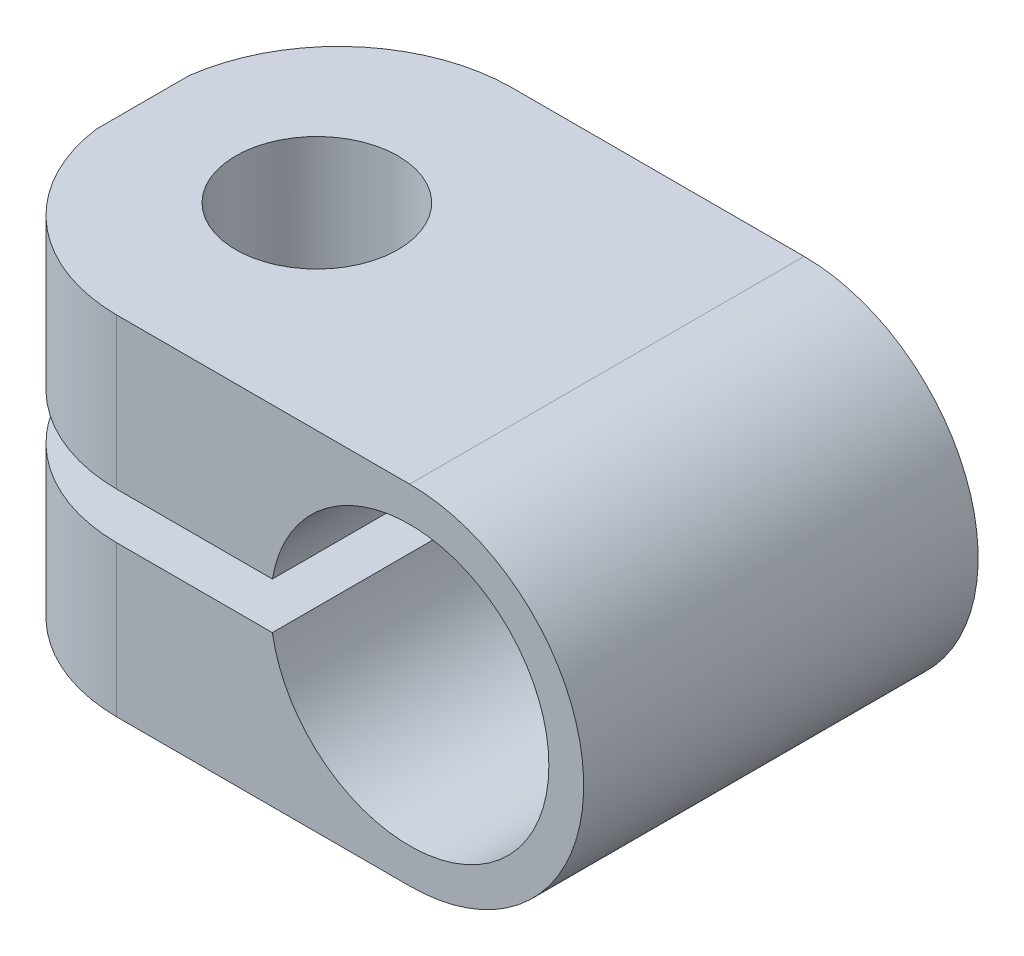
ISO-10303-21;
HEADER;
FILE_DESCRIPTION(('STEP AP214'),'2;1');
FILE_NAME('part.step','',(''),(''),'','','');
FILE_SCHEMA(('AUTOMOTIVE_DESIGN { 1 0 10303 214 1 1 1 1 }'));
ENDSEC;
DATA;
#1=APPLICATION_CONTEXT('core data for automotive mechanical design processes');
#2=APPLICATION_PROTOCOL_DEFINITION('international standard','automotive_design',2000,#1);
#3=PRODUCT_CONTEXT('',#1,'mechanical');
#4=PRODUCT('Part','Part','',(#3));
#5=PRODUCT_RELATED_PRODUCT_CATEGORY('part','',(#4));
#6=PRODUCT_DEFINITION_FORMATION('','',#4);
#7=PRODUCT_DEFINITION_CONTEXT('part definition',#1,'design');
#8=PRODUCT_DEFINITION('design','',#6,#7);
#9=PRODUCT_DEFINITION_SHAPE('','',#8);
#10=(LENGTH_UNIT() NAMED_UNIT(*) SI_UNIT(.MILLI.,.METRE.));
#11=(NAMED_UNIT(*) PLANE_ANGLE_UNIT() SI_UNIT($,.RADIAN.));
#12=(NAMED_UNIT(*) SI_UNIT($,.STERADIAN.) SOLID_ANGLE_UNIT());
#13=UNCERTAINTY_MEASURE_WITH_UNIT(LENGTH_MEASURE(1.E-05),#10,'distance_accuracy_value','');
#14=(GEOMETRIC_REPRESENTATION_CONTEXT(3) GLOBAL_UNCERTAINTY_ASSIGNED_CONTEXT((#13)) GLOBAL_UNIT_ASSIGNED_CONTEXT((#10,
#11,#12)) REPRESENTATION_CONTEXT('',''));
#15=CARTESIAN_POINT('',(0.,0.,0.));
#16=DIRECTION('',(0.,0.,1.));
#17=DIRECTION('',(1.,0.,0.));
#18=AXIS2_PLACEMENT_3D('',#15,#16,#17);
#19=CARTESIAN_POINT('',(0.,0.,17.));
#20=DIRECTION('',(1.,0.,0.));
#21=DIRECTION('',(0.,0.,-1.));
#22=AXIS2_PLACEMENT_3D('',#19,#20,#21);
#23=PLANE('',#22);
#24=DIRECTION('',(0.,0.,1.));
#25=VECTOR('',#24,1.);
#26=CARTESIAN_POINT('',(0.,8.5,0.));
#27=LINE('',#26,#25);
#28=CARTESIAN_POINT('',(0.,8.5,6.49940134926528));
#29=VERTEX_POINT('',#28);
#30=CARTESIAN_POINT('',(0.,8.5,10.5005986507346));
#31=VERTEX_POINT('',#30);
#32=EDGE_CURVE('E178',#29,#31,#27,.T.);
#33=ORIENTED_EDGE('',*,*,#32,.T.);
#34=DIRECTION('',(0.,-1.,0.));
#35=VECTOR('',#34,1.);
#36=CARTESIAN_POINT('',(0.,15.,10.5005986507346));
#37=LINE('',#36,#35);
#38=CARTESIAN_POINT('',(0.,15.,10.5005986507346));
#39=VERTEX_POINT('',#38);
#40=EDGE_CURVE('E201',#31,#39,#37,.F.);
#41=ORIENTED_EDGE('',*,*,#40,.T.);
#42=DIRECTION('',(0.,0.,-1.));
#43=VECTOR('',#42,1.);
#44=CARTESIAN_POINT('',(0.,15.,17.));
#45=LINE('',#44,#43);
#46=CARTESIAN_POINT('',(0.,15.,6.49940134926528));
#47=VERTEX_POINT('',#46);
#48=EDGE_CURVE('E160',#39,#47,#45,.T.);
#49=ORIENTED_EDGE('',*,*,#48,.T.);
#50=DIRECTION('',(0.,-1.,0.));
#51=VECTOR('',#50,1.);
#52=CARTESIAN_POINT('',(0.,15.,6.49940134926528));
#53=LINE('',#52,#51);
#54=EDGE_CURVE('E185',#47,#29,#53,.T.);
#55=ORIENTED_EDGE('',*,*,#54,.T.);
#56=EDGE_LOOP('',(#33,#41,#49,#55));
#57=FACE_BOUND('',#56,.T.);
#58=ADVANCED_FACE('F28',(#57),#23,.F.);
#59=CARTESIAN_POINT('',(0.,0.,17.));
#60=DIRECTION('',(0.,1.,0.));
#61=DIRECTION('',(0.,0.,1.));
#62=AXIS2_PLACEMENT_3D('',#59,#60,#61);
#63=PLANE('',#62);
#64=CARTESIAN_POINT('',(7.5,0.,8.5));
#65=DIRECTION('',(0.,-1.,0.));
#66=DIRECTION('',(0.,0.,-1.));
#67=AXIS2_PLACEMENT_3D('',#64,#65,#66);
#68=CIRCLE('',#67,3.5);
#69=CARTESIAN_POINT('',(7.5,0.,5.));
#70=VERTEX_POINT('',#69);
#71=EDGE_CURVE('E244',#70,#70,#68,.T.);
#72=ORIENTED_EDGE('',*,*,#71,.F.);
#73=EDGE_LOOP('',(#72));
#74=FACE_BOUND('',#73,.T.);
#75=DIRECTION('',(1.,0.,0.));
#76=VECTOR('',#75,1.);
#77=CARTESIAN_POINT('',(0.,0.,17.));
#78=LINE('',#77,#76);
#79=CARTESIAN_POINT('',(7.36598819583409,0.,17.));
#80=VERTEX_POINT('',#79);
#81=CARTESIAN_POINT('',(20.,0.,17.));
#82=VERTEX_POINT('',#81);
#83=EDGE_CURVE('E153',#80,#82,#78,.T.);
#84=ORIENTED_EDGE('',*,*,#83,.F.);
#85=CARTESIAN_POINT('',(7.43299409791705,0.,9.50029932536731));
#86=DIRECTION('',(0.,1.,0.));
#87=DIRECTION('',(0.,0.,-1.));
#88=AXIS2_PLACEMENT_3D('',#85,#86,#87);
#89=CIRCLE('',#88,7.5);
#90=CARTESIAN_POINT('',(0.,0.,10.5005986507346));
#91=VERTEX_POINT('',#90);
#92=EDGE_CURVE('E137',#91,#80,#89,.T.);
#93=ORIENTED_EDGE('',*,*,#92,.F.);
#94=DIRECTION('',(0.,0.,-1.));
#95=VECTOR('',#94,1.);
#96=CARTESIAN_POINT('',(0.,0.,17.));
#97=LINE('',#96,#95);
#98=CARTESIAN_POINT('',(0.,0.,6.49940134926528));
#99=VERTEX_POINT('',#98);
#100=EDGE_CURVE('E135',#91,#99,#97,.T.);
#101=ORIENTED_EDGE('',*,*,#100,.T.);
#102=CARTESIAN_POINT('',(7.43299409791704,0.,7.49970067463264));
#103=DIRECTION('',(0.,1.,0.));
#104=DIRECTION('',(0.,0.,1.));
#105=AXIS2_PLACEMENT_3D('',#102,#103,#104);
#106=CIRCLE('',#105,7.5);
#107=CARTESIAN_POINT('',(7.36598819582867,0.,0.));
#108=VERTEX_POINT('',#107);
#109=EDGE_CURVE('E121',#108,#99,#106,.T.);
#110=ORIENTED_EDGE('',*,*,#109,.F.);
#111=DIRECTION('',(1.,0.,0.));
#112=VECTOR('',#111,1.);
#113=CARTESIAN_POINT('',(0.,0.,0.));
#114=LINE('',#113,#112);
#115=CARTESIAN_POINT('',(20.,0.,0.));
#116=VERTEX_POINT('',#115);
#117=EDGE_CURVE('E131',#108,#116,#114,.T.);
#118=ORIENTED_EDGE('',*,*,#117,.T.);
#119=DIRECTION('',(0.,0.,-1.));
#120=VECTOR('',#119,1.);
#121=CARTESIAN_POINT('',(20.,0.,17.));
#122=LINE('',#121,#120);
#123=EDGE_CURVE('E165',#82,#116,#122,.T.);
#124=ORIENTED_EDGE('',*,*,#123,.F.);
#125=EDGE_LOOP('',(#84,#93,#101,#110,#118,#124));
#126=FACE_BOUND('',#125,.T.);
#127=ADVANCED_FACE('F30',(#74,#126),#63,.F.);
#128=CARTESIAN_POINT('',(20.,7.5,17.));
#129=DIRECTION('',(0.,0.,-1.));
#130=DIRECTION('',(-1.,0.,0.));
#131=AXIS2_PLACEMENT_3D('',#128,#129,#130);
#132=CYLINDRICAL_SURFACE('',#131,7.5);
#133=CARTESIAN_POINT('',(20.,7.5,0.));
#134=DIRECTION('',(0.,0.,1.));
#135=DIRECTION('',(-1.,0.,0.));
#136=AXIS2_PLACEMENT_3D('',#133,#134,#135);
#137=CIRCLE('',#136,7.5);
#138=CARTESIAN_POINT('',(20.,15.,0.));
#139=VERTEX_POINT('',#138);
#140=EDGE_CURVE('E141',#116,#139,#137,.T.);
#141=ORIENTED_EDGE('',*,*,#140,.T.);
#142=DIRECTION('',(0.,0.,-1.));
#143=VECTOR('',#142,1.);
#144=CARTESIAN_POINT('',(20.,15.,17.));
#145=LINE('',#144,#143);
#146=CARTESIAN_POINT('',(20.,15.,17.));
#147=VERTEX_POINT('',#146);
#148=EDGE_CURVE('E162',#147,#139,#145,.T.);
#149=ORIENTED_EDGE('',*,*,#148,.F.);
#150=CARTESIAN_POINT('',(20.,7.5,17.));
#151=DIRECTION('',(0.,0.,1.));
#152=DIRECTION('',(-1.,0.,0.));
#153=AXIS2_PLACEMENT_3D('',#150,#151,#152);
#154=CIRCLE('',#153,7.5);
#155=EDGE_CURVE('E155',#82,#147,#154,.T.);
#156=ORIENTED_EDGE('',*,*,#155,.F.);
#157=ORIENTED_EDGE('',*,*,#123,.T.);
#158=EDGE_LOOP('',(#141,#149,#156,#157));
#159=FACE_BOUND('',#158,.T.);
#160=ADVANCED_FACE('F252',(#159),#132,.T.);
#161=CARTESIAN_POINT('',(0.,15.,17.));
#162=DIRECTION('',(0.,-1.,0.));
#163=DIRECTION('',(0.,0.,-1.));
#164=AXIS2_PLACEMENT_3D('',#161,#162,#163);
#165=PLANE('',#164);
#166=CARTESIAN_POINT('',(7.5,15.,8.5));
#167=DIRECTION('',(0.,-1.,0.));
#168=DIRECTION('',(0.,0.,-1.));
#169=AXIS2_PLACEMENT_3D('',#166,#167,#168);
#170=CIRCLE('',#169,3.5);
#171=CARTESIAN_POINT('',(7.5,15.,5.));
#172=VERTEX_POINT('',#171);
#173=EDGE_CURVE('E241',#172,#172,#170,.T.);
#174=ORIENTED_EDGE('',*,*,#173,.T.);
#175=EDGE_LOOP('',(#174));
#176=FACE_BOUND('',#175,.T.);
#177=ORIENTED_EDGE('',*,*,#48,.F.);
#178=CARTESIAN_POINT('',(7.43299409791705,15.,9.50029932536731));
#179=DIRECTION('',(0.,1.,0.));
#180=DIRECTION('',(0.,0.,-1.));
#181=AXIS2_PLACEMENT_3D('',#178,#179,#180);
#182=CIRCLE('',#181,7.5);
#183=CARTESIAN_POINT('',(7.36598819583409,15.,17.));
#184=VERTEX_POINT('',#183);
#185=EDGE_CURVE('E136',#39,#184,#182,.T.);
#186=ORIENTED_EDGE('',*,*,#185,.T.);
#187=DIRECTION('',(-1.,0.,0.));
#188=VECTOR('',#187,1.);
#189=CARTESIAN_POINT('',(0.,15.,17.));
#190=LINE('',#189,#188);
#191=EDGE_CURVE('E157',#147,#184,#190,.T.);
#192=ORIENTED_EDGE('',*,*,#191,.F.);
#193=ORIENTED_EDGE('',*,*,#148,.T.);
#194=DIRECTION('',(-1.,0.,0.));
#195=VECTOR('',#194,1.);
#196=CARTESIAN_POINT('',(0.,15.,0.));
#197=LINE('',#196,#195);
#198=CARTESIAN_POINT('',(7.36598819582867,15.,0.));
#199=VERTEX_POINT('',#198);
#200=EDGE_CURVE('E145',#139,#199,#197,.T.);
#201=ORIENTED_EDGE('',*,*,#200,.T.);
#202=CARTESIAN_POINT('',(7.43299409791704,15.,7.49970067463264));
#203=DIRECTION('',(0.,1.,0.));
#204=DIRECTION('',(0.,0.,1.));
#205=AXIS2_PLACEMENT_3D('',#202,#203,#204);
#206=CIRCLE('',#205,7.5);
#207=EDGE_CURVE('E194',#199,#47,#206,.T.);
#208=ORIENTED_EDGE('',*,*,#207,.T.);
#209=EDGE_LOOP('',(#177,#186,#192,#193,#201,#208));
#210=FACE_BOUND('',#209,.T.);
#211=ADVANCED_FACE('F233',(#176,#210),#165,.F.);
#212=DIRECTION('',(0.,-1.,0.));
#213=VECTOR('',#212,1.);
#214=CARTESIAN_POINT('',(0.,15.,6.49940134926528));
#215=LINE('',#214,#213);
#216=CARTESIAN_POINT('',(0.,6.5,6.49940134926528));
#217=VERTEX_POINT('',#216);
#218=EDGE_CURVE('E52',#217,#99,#215,.T.);
#219=ORIENTED_EDGE('',*,*,#218,.T.);
#220=ORIENTED_EDGE('',*,*,#100,.F.);
#221=DIRECTION('',(0.,-1.,0.));
#222=VECTOR('',#221,1.);
#223=CARTESIAN_POINT('',(0.,15.,10.5005986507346));
#224=LINE('',#223,#222);
#225=CARTESIAN_POINT('',(0.,6.5,10.5005986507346));
#226=VERTEX_POINT('',#225);
#227=EDGE_CURVE('E205',#91,#226,#224,.F.);
#228=ORIENTED_EDGE('',*,*,#227,.T.);
#229=DIRECTION('',(0.,0.,1.));
#230=VECTOR('',#229,1.);
#231=CARTESIAN_POINT('',(0.,6.5,0.));
#232=LINE('',#231,#230);
#233=EDGE_CURVE('E215',#217,#226,#232,.T.);
#234=ORIENTED_EDGE('',*,*,#233,.F.);
#235=EDGE_LOOP('',(#219,#220,#228,#234));
#236=FACE_BOUND('',#235,.T.);
#237=ADVANCED_FACE('F259',(#236),#23,.F.);
#238=CARTESIAN_POINT('',(20.,7.5,17.));
#239=DIRECTION('',(0.,0.,-1.));
#240=DIRECTION('',(-1.,0.,0.));
#241=AXIS2_PLACEMENT_3D('',#238,#239,#240);
#242=PLANE('',#241);
#243=ORIENTED_EDGE('',*,*,#191,.T.);
#244=DIRECTION('',(0.,-1.,0.));
#245=VECTOR('',#244,1.);
#246=CARTESIAN_POINT('',(7.36598819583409,15.,17.));
#247=LINE('',#246,#245);
#248=CARTESIAN_POINT('',(7.36598819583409,8.5,17.));
#249=VERTEX_POINT('',#248);
#250=EDGE_CURVE('E198',#184,#249,#247,.T.);
#251=ORIENTED_EDGE('',*,*,#250,.T.);
#252=DIRECTION('',(-1.,0.,0.));
#253=VECTOR('',#252,1.);
#254=CARTESIAN_POINT('',(0.,8.5,17.));
#255=LINE('',#254,#253);
#256=CARTESIAN_POINT('',(14.0839202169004,8.5,17.));
#257=VERTEX_POINT('',#256);
#258=EDGE_CURVE('E210',#257,#249,#255,.T.);
#259=ORIENTED_EDGE('',*,*,#258,.F.);
#260=CARTESIAN_POINT('',(20.,7.5,17.));
#261=DIRECTION('',(0.,0.,1.));
#262=DIRECTION('',(1.,0.,0.));
#263=AXIS2_PLACEMENT_3D('',#260,#261,#262);
#264=CIRCLE('',#263,6.);
#265=CARTESIAN_POINT('',(14.0839202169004,6.5,17.));
#266=VERTEX_POINT('',#265);
#267=EDGE_CURVE('E148',#266,#257,#264,.T.);
#268=ORIENTED_EDGE('',*,*,#267,.F.);
#269=DIRECTION('',(1.,0.,0.));
#270=VECTOR('',#269,1.);
#271=CARTESIAN_POINT('',(16.436428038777,6.5,17.));
#272=LINE('',#271,#270);
#273=CARTESIAN_POINT('',(7.36598819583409,6.5,17.));
#274=VERTEX_POINT('',#273);
#275=EDGE_CURVE('E208',#274,#266,#272,.T.);
#276=ORIENTED_EDGE('',*,*,#275,.F.);
#277=EDGE_CURVE('E44',#274,#80,#247,.T.);
#278=ORIENTED_EDGE('',*,*,#277,.T.);
#279=ORIENTED_EDGE('',*,*,#83,.T.);
#280=ORIENTED_EDGE('',*,*,#155,.T.);
#281=EDGE_LOOP('',(#243,#251,#259,#268,#276,#278,#279,#280));
#282=FACE_BOUND('',#281,.T.);
#283=ADVANCED_FACE('F226',(#282),#242,.F.);
#284=CARTESIAN_POINT('',(20.,7.5,0.));
#285=DIRECTION('',(0.,0.,-1.));
#286=DIRECTION('',(-1.,0.,0.));
#287=AXIS2_PLACEMENT_3D('',#284,#285,#286);
#288=PLANE('',#287);
#289=DIRECTION('',(-1.,0.,0.));
#290=VECTOR('',#289,1.);
#291=CARTESIAN_POINT('',(0.,8.5,0.));
#292=LINE('',#291,#290);
#293=CARTESIAN_POINT('',(14.0839202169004,8.5,0.));
#294=VERTEX_POINT('',#293);
#295=CARTESIAN_POINT('',(7.36598819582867,8.5,0.));
#296=VERTEX_POINT('',#295);
#297=EDGE_CURVE('E177',#294,#296,#292,.T.);
#298=ORIENTED_EDGE('',*,*,#297,.T.);
#299=DIRECTION('',(0.,-1.,0.));
#300=VECTOR('',#299,1.);
#301=CARTESIAN_POINT('',(7.36598819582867,15.,0.));
#302=LINE('',#301,#300);
#303=EDGE_CURVE('E127',#199,#296,#302,.T.);
#304=ORIENTED_EDGE('',*,*,#303,.F.);
#305=ORIENTED_EDGE('',*,*,#200,.F.);
#306=ORIENTED_EDGE('',*,*,#140,.F.);
#307=ORIENTED_EDGE('',*,*,#117,.F.);
#308=CARTESIAN_POINT('',(7.36598819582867,6.5,0.));
#309=VERTEX_POINT('',#308);
#310=EDGE_CURVE('E118',#309,#108,#302,.T.);
#311=ORIENTED_EDGE('',*,*,#310,.F.);
#312=DIRECTION('',(1.,0.,0.));
#313=VECTOR('',#312,1.);
#314=CARTESIAN_POINT('',(16.436428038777,6.5,0.));
#315=LINE('',#314,#313);
#316=CARTESIAN_POINT('',(14.0839202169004,6.5,0.));
#317=VERTEX_POINT('',#316);
#318=EDGE_CURVE('E212',#309,#317,#315,.T.);
#319=ORIENTED_EDGE('',*,*,#318,.T.);
#320=CARTESIAN_POINT('',(20.,7.5,0.));
#321=DIRECTION('',(0.,0.,1.));
#322=DIRECTION('',(1.,0.,0.));
#323=AXIS2_PLACEMENT_3D('',#320,#321,#322);
#324=CIRCLE('',#323,6.);
#325=EDGE_CURVE('E143',#317,#294,#324,.T.);
#326=ORIENTED_EDGE('',*,*,#325,.T.);
#327=EDGE_LOOP('',(#298,#304,#305,#306,#307,#311,#319,#326));
#328=FACE_BOUND('',#327,.T.);
#329=ADVANCED_FACE('F139',(#328),#288,.T.);
#330=CARTESIAN_POINT('',(20.,7.5,0.));
#331=DIRECTION('',(0.,0.,1.));
#332=DIRECTION('',(1.,0.,0.));
#333=AXIS2_PLACEMENT_3D('',#330,#331,#332);
#334=CYLINDRICAL_SURFACE('',#333,6.);
#335=ORIENTED_EDGE('',*,*,#267,.T.);
#336=DIRECTION('',(0.,0.,1.));
#337=VECTOR('',#336,1.);
#338=CARTESIAN_POINT('',(14.0839202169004,8.5,0.));
#339=LINE('',#338,#337);
#340=EDGE_CURVE('E170',#257,#294,#339,.F.);
#341=ORIENTED_EDGE('',*,*,#340,.T.);
#342=ORIENTED_EDGE('',*,*,#325,.F.);
#343=DIRECTION('',(0.,0.,1.));
#344=VECTOR('',#343,1.);
#345=CARTESIAN_POINT('',(14.0839202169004,6.5,0.));
#346=LINE('',#345,#344);
#347=EDGE_CURVE('E167',#317,#266,#346,.T.);
#348=ORIENTED_EDGE('',*,*,#347,.T.);
#349=EDGE_LOOP('',(#335,#341,#342,#348));
#350=FACE_BOUND('',#349,.T.);
#351=ADVANCED_FACE('F220',(#350),#334,.F.);
#352=CARTESIAN_POINT('',(16.436428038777,6.5,0.));
#353=DIRECTION('',(0.,-1.,0.));
#354=DIRECTION('',(1.,0.,0.));
#355=AXIS2_PLACEMENT_3D('',#352,#353,#354);
#356=PLANE('',#355);
#357=CARTESIAN_POINT('',(7.5,6.5,8.5));
#358=DIRECTION('',(0.,-1.,0.));
#359=DIRECTION('',(1.,0.,0.));
#360=AXIS2_PLACEMENT_3D('',#357,#358,#359);
#361=CIRCLE('',#360,3.5);
#362=CARTESIAN_POINT('',(11.,6.5,8.5));
#363=VERTEX_POINT('',#362);
#364=EDGE_CURVE('E238',#363,#363,#361,.T.);
#365=ORIENTED_EDGE('',*,*,#364,.T.);
#366=EDGE_LOOP('',(#365));
#367=FACE_BOUND('',#366,.T.);
#368=ORIENTED_EDGE('',*,*,#233,.T.);
#369=CARTESIAN_POINT('',(7.43299409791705,6.5,9.50029932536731));
#370=DIRECTION('',(0.,-1.,0.));
#371=DIRECTION('',(1.,0.,0.));
#372=AXIS2_PLACEMENT_3D('',#369,#370,#371);
#373=CIRCLE('',#372,7.5);
#374=EDGE_CURVE('E203',#226,#274,#373,.F.);
#375=ORIENTED_EDGE('',*,*,#374,.T.);
#376=ORIENTED_EDGE('',*,*,#275,.T.);
#377=ORIENTED_EDGE('',*,*,#347,.F.);
#378=ORIENTED_EDGE('',*,*,#318,.F.);
#379=CARTESIAN_POINT('',(7.43299409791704,6.5,7.49970067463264));
#380=DIRECTION('',(0.,-1.,0.));
#381=DIRECTION('',(1.,0.,0.));
#382=AXIS2_PLACEMENT_3D('',#379,#380,#381);
#383=CIRCLE('',#382,7.5);
#384=EDGE_CURVE('E122',#309,#217,#383,.F.);
#385=ORIENTED_EDGE('',*,*,#384,.T.);
#386=EDGE_LOOP('',(#368,#375,#376,#377,#378,#385));
#387=FACE_BOUND('',#386,.T.);
#388=ADVANCED_FACE('F273',(#367,#387),#356,.F.);
#389=CARTESIAN_POINT('',(0.,8.5,0.));
#390=DIRECTION('',(0.,1.,0.));
#391=DIRECTION('',(0.,0.,1.));
#392=AXIS2_PLACEMENT_3D('',#389,#390,#391);
#393=PLANE('',#392);
#394=CARTESIAN_POINT('',(7.5,8.5,8.5));
#395=DIRECTION('',(0.,1.,0.));
#396=DIRECTION('',(0.,0.,1.));
#397=AXIS2_PLACEMENT_3D('',#394,#395,#396);
#398=CIRCLE('',#397,3.5);
#399=CARTESIAN_POINT('',(7.5,8.5,12.));
#400=VERTEX_POINT('',#399);
#401=EDGE_CURVE('E32',#400,#400,#398,.T.);
#402=ORIENTED_EDGE('',*,*,#401,.T.);
#403=EDGE_LOOP('',(#402));
#404=FACE_BOUND('',#403,.T.);
#405=ORIENTED_EDGE('',*,*,#258,.T.);
#406=CARTESIAN_POINT('',(7.43299409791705,8.5,9.50029932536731));
#407=DIRECTION('',(0.,1.,0.));
#408=DIRECTION('',(0.,0.,1.));
#409=AXIS2_PLACEMENT_3D('',#406,#407,#408);
#410=CIRCLE('',#409,7.5);
#411=EDGE_CURVE('E11',#249,#31,#410,.F.);
#412=ORIENTED_EDGE('',*,*,#411,.T.);
#413=ORIENTED_EDGE('',*,*,#32,.F.);
#414=CARTESIAN_POINT('',(7.43299409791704,8.5,7.49970067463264));
#415=DIRECTION('',(0.,1.,0.));
#416=DIRECTION('',(0.,0.,1.));
#417=AXIS2_PLACEMENT_3D('',#414,#415,#416);
#418=CIRCLE('',#417,7.5);
#419=EDGE_CURVE('E37',#29,#296,#418,.F.);
#420=ORIENTED_EDGE('',*,*,#419,.T.);
#421=ORIENTED_EDGE('',*,*,#297,.F.);
#422=ORIENTED_EDGE('',*,*,#340,.F.);
#423=EDGE_LOOP('',(#405,#412,#413,#420,#421,#422));
#424=FACE_BOUND('',#423,.T.);
#425=ADVANCED_FACE('F176',(#404,#424),#393,.F.);
#426=CARTESIAN_POINT('',(7.43299409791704,15.,7.49970067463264));
#427=DIRECTION('',(0.,-1.,0.));
#428=DIRECTION('',(0.,0.,-1.));
#429=AXIS2_PLACEMENT_3D('',#426,#427,#428);
#430=CYLINDRICAL_SURFACE('',#429,7.5);
#431=ORIENTED_EDGE('',*,*,#207,.F.);
#432=ORIENTED_EDGE('',*,*,#303,.T.);
#433=ORIENTED_EDGE('',*,*,#419,.F.);
#434=ORIENTED_EDGE('',*,*,#54,.F.);
#435=EDGE_LOOP('',(#431,#432,#433,#434));
#436=FACE_BOUND('',#435,.T.);
#437=ADVANCED_FACE('F184',(#436),#430,.T.);
#438=CARTESIAN_POINT('',(7.43299409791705,15.,9.50029932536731));
#439=DIRECTION('',(0.,-1.,0.));
#440=DIRECTION('',(0.,0.,-1.));
#441=AXIS2_PLACEMENT_3D('',#438,#439,#440);
#442=CYLINDRICAL_SURFACE('',#441,7.5);
#443=ORIENTED_EDGE('',*,*,#411,.F.);
#444=ORIENTED_EDGE('',*,*,#250,.F.);
#445=ORIENTED_EDGE('',*,*,#185,.F.);
#446=ORIENTED_EDGE('',*,*,#40,.F.);
#447=EDGE_LOOP('',(#443,#444,#445,#446));
#448=FACE_BOUND('',#447,.T.);
#449=ADVANCED_FACE('F230',(#448),#442,.T.);
#450=ORIENTED_EDGE('',*,*,#384,.F.);
#451=ORIENTED_EDGE('',*,*,#310,.T.);
#452=ORIENTED_EDGE('',*,*,#109,.T.);
#453=ORIENTED_EDGE('',*,*,#218,.F.);
#454=EDGE_LOOP('',(#450,#451,#452,#453));
#455=FACE_BOUND('',#454,.T.);
#456=ADVANCED_FACE('F120',(#455),#430,.T.);
#457=ORIENTED_EDGE('',*,*,#92,.T.);
#458=ORIENTED_EDGE('',*,*,#277,.F.);
#459=ORIENTED_EDGE('',*,*,#374,.F.);
#460=ORIENTED_EDGE('',*,*,#227,.F.);
#461=EDGE_LOOP('',(#457,#458,#459,#460));
#462=FACE_BOUND('',#461,.T.);
#463=ADVANCED_FACE('F274',(#462),#442,.T.);
#464=CARTESIAN_POINT('',(7.5,15.,8.5));
#465=DIRECTION('',(0.,-1.,0.));
#466=DIRECTION('',(0.,0.,-1.));
#467=AXIS2_PLACEMENT_3D('',#464,#465,#466);
#468=CYLINDRICAL_SURFACE('',#467,3.5);
#469=ORIENTED_EDGE('',*,*,#173,.F.);
#470=EDGE_LOOP('',(#469));
#471=FACE_BOUND('',#470,.T.);
#472=ORIENTED_EDGE('',*,*,#401,.F.);
#473=EDGE_LOOP('',(#472));
#474=FACE_BOUND('',#473,.T.);
#475=ADVANCED_FACE('F278',(#471,#474),#468,.F.);
#476=ORIENTED_EDGE('',*,*,#71,.T.);
#477=EDGE_LOOP('',(#476));
#478=FACE_BOUND('',#477,.T.);
#479=ORIENTED_EDGE('',*,*,#364,.F.);
#480=EDGE_LOOP('',(#479));
#481=FACE_BOUND('',#480,.T.);
#482=ADVANCED_FACE('F248',(#478,#481),#468,.F.);
#483=CLOSED_SHELL('',(#58,#127,#160,#211,#237,#283,#329,#351,#388,#425,#437,#449,#456,#463,#475,#482));
#484=MANIFOLD_SOLID_BREP('B2',#483);
#485=ADVANCED_BREP_SHAPE_REPRESENTATION('',(#18,#484),#14);
#486=SHAPE_DEFINITION_REPRESENTATION(#9,#485);
ENDSEC;
END-ISO-10303-21;
